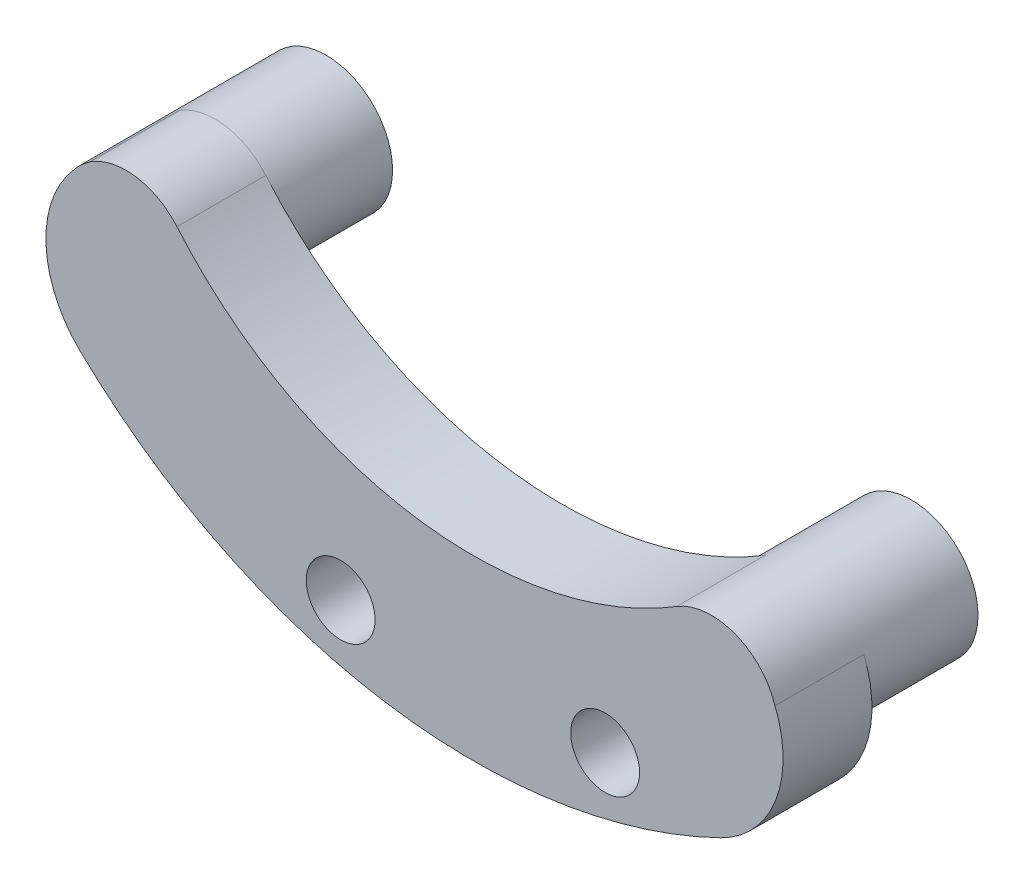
ISO-10303-21;
HEADER;
FILE_DESCRIPTION(('STEP AP214'),'2;1');
FILE_NAME('part.step','',(''),(''),'','','');
FILE_SCHEMA(('AUTOMOTIVE_DESIGN { 1 0 10303 214 1 1 1 1 }'));
ENDSEC;
DATA;
#1=APPLICATION_CONTEXT('core data for automotive mechanical design processes');
#2=APPLICATION_PROTOCOL_DEFINITION('international standard','automotive_design',2000,#1);
#3=PRODUCT_CONTEXT('',#1,'mechanical');
#4=PRODUCT('Part','Part','',(#3));
#5=PRODUCT_RELATED_PRODUCT_CATEGORY('part','',(#4));
#6=PRODUCT_DEFINITION_FORMATION('','',#4);
#7=PRODUCT_DEFINITION_CONTEXT('part definition',#1,'design');
#8=PRODUCT_DEFINITION('design','',#6,#7);
#9=PRODUCT_DEFINITION_SHAPE('','',#8);
#10=(LENGTH_UNIT() NAMED_UNIT(*) SI_UNIT(.MILLI.,.METRE.));
#11=(NAMED_UNIT(*) PLANE_ANGLE_UNIT() SI_UNIT($,.RADIAN.));
#12=(NAMED_UNIT(*) SI_UNIT($,.STERADIAN.) SOLID_ANGLE_UNIT());
#13=UNCERTAINTY_MEASURE_WITH_UNIT(LENGTH_MEASURE(1.E-05),#10,'distance_accuracy_value','');
#14=(GEOMETRIC_REPRESENTATION_CONTEXT(3) GLOBAL_UNCERTAINTY_ASSIGNED_CONTEXT((#13)) GLOBAL_UNIT_ASSIGNED_CONTEXT((#10,
#11,#12)) REPRESENTATION_CONTEXT('',''));
#15=CARTESIAN_POINT('',(0.,0.,0.));
#16=DIRECTION('',(0.,0.,1.));
#17=DIRECTION('',(1.,0.,0.));
#18=AXIS2_PLACEMENT_3D('',#15,#16,#17);
#19=CARTESIAN_POINT('',(-14.2219376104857,-14.7643655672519,4.));
#20=DIRECTION('',(0.,0.,1.));
#21=DIRECTION('',(1.,0.,0.));
#22=AXIS2_PLACEMENT_3D('',#19,#20,#21);
#23=CYLINDRICAL_SURFACE('',#22,5.);
#24=DIRECTION('',(0.,0.,1.));
#25=VECTOR('',#24,1.);
#26=CARTESIAN_POINT('',(-17.9747598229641,-11.4603792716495,-0.5));
#27=LINE('',#26,#25);
#28=CARTESIAN_POINT('',(-17.9747598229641,-11.4603792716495,0.));
#29=VERTEX_POINT('',#28);
#30=CARTESIAN_POINT('',(-17.9747598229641,-11.4603792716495,4.));
#31=VERTEX_POINT('',#30);
#32=EDGE_CURVE('E42',#29,#31,#27,.T.);
#33=ORIENTED_EDGE('',*,*,#32,.F.);
#34=CARTESIAN_POINT('',(-14.2219376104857,-14.7643655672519,0.));
#35=DIRECTION('',(0.,0.,1.));
#36=DIRECTION('',(1.,0.,0.));
#37=AXIS2_PLACEMENT_3D('',#34,#35,#36);
#38=CIRCLE('',#37,5.);
#39=CARTESIAN_POINT('',(-17.6907028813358,-18.3654303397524,0.));
#40=VERTEX_POINT('',#39);
#41=EDGE_CURVE('E143',#40,#29,#38,.F.);
#42=ORIENTED_EDGE('',*,*,#41,.F.);
#43=DIRECTION('',(0.,0.,-1.));
#44=VECTOR('',#43,1.);
#45=CARTESIAN_POINT('',(-17.6907028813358,-18.3654303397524,4.));
#46=LINE('',#45,#44);
#47=CARTESIAN_POINT('',(-17.6907028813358,-18.3654303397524,4.));
#48=VERTEX_POINT('',#47);
#49=EDGE_CURVE('E139',#48,#40,#46,.T.);
#50=ORIENTED_EDGE('',*,*,#49,.F.);
#51=CARTESIAN_POINT('',(-14.2219376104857,-14.7643655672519,4.));
#52=DIRECTION('',(0.,0.,1.));
#53=DIRECTION('',(1.,0.,0.));
#54=AXIS2_PLACEMENT_3D('',#51,#52,#53);
#55=CIRCLE('',#54,5.);
#56=EDGE_CURVE('E125',#31,#48,#55,.T.);
#57=ORIENTED_EDGE('',*,*,#56,.F.);
#58=EDGE_LOOP('',(#33,#42,#50,#57));
#59=FACE_BOUND('',#58,.T.);
#60=ADVANCED_FACE('F34',(#59),#23,.T.);
#61=CARTESIAN_POINT('',(0.,0.,4.));
#62=DIRECTION('',(0.,0.,1.));
#63=DIRECTION('',(1.,0.,0.));
#64=AXIS2_PLACEMENT_3D('',#61,#62,#63);
#65=PLANE('',#64);
#66=CARTESIAN_POINT('',(8.96342656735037,-18.436566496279,4.));
#67=DIRECTION('',(0.,0.,1.));
#68=DIRECTION('',(1.,0.,0.));
#69=AXIS2_PLACEMENT_3D('',#66,#67,#68);
#70=CIRCLE('',#69,5.);
#71=CARTESIAN_POINT('',(11.1496281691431,-22.9332900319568,4.));
#72=VERTEX_POINT('',#71);
#73=CARTESIAN_POINT('',(13.5980959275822,-16.5604428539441,4.));
#74=VERTEX_POINT('',#73);
#75=EDGE_CURVE('E116',#72,#74,#70,.T.);
#76=ORIENTED_EDGE('',*,*,#75,.T.);
#77=CARTESIAN_POINT('',(10.7371493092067,-17.4632077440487,4.));
#78=DIRECTION('',(0.,0.,1.));
#79=DIRECTION('',(1.,0.,0.));
#80=AXIS2_PLACEMENT_3D('',#77,#78,#79);
#81=CIRCLE('',#80,3.);
#82=CARTESIAN_POINT('',(9.16585916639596,-14.9076163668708,4.));
#83=VERTEX_POINT('',#82);
#84=EDGE_CURVE('E99',#74,#83,#81,.T.);
#85=ORIENTED_EDGE('',*,*,#84,.T.);
#86=CARTESIAN_POINT('',(0.,0.,4.));
#87=DIRECTION('',(0.,0.,-1.));
#88=DIRECTION('',(1.,0.,0.));
#89=AXIS2_PLACEMENT_3D('',#86,#87,#88);
#90=CIRCLE('',#89,17.5);
#91=CARTESIAN_POINT('',(-13.3239568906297,-11.3455794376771,4.));
#92=VERTEX_POINT('',#91);
#93=EDGE_CURVE('E156',#83,#92,#90,.T.);
#94=ORIENTED_EDGE('',*,*,#93,.T.);
#95=CARTESIAN_POINT('',(-15.6080637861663,-13.2905359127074,4.));
#96=DIRECTION('',(0.,0.,1.));
#97=DIRECTION('',(1.,0.,0.));
#98=AXIS2_PLACEMENT_3D('',#95,#96,#97);
#99=CIRCLE('',#98,3.);
#100=CARTESIAN_POINT('',(-17.1978215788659,-10.7463916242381,4.));
#101=VERTEX_POINT('',#100);
#102=EDGE_CURVE('E110',#92,#101,#99,.T.);
#103=ORIENTED_EDGE('',*,*,#102,.T.);
#104=CARTESIAN_POINT('',(-17.289763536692,-10.8161451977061,4.));
#105=VERTEX_POINT('',#104);
#106=EDGE_CURVE('E122',#101,#105,#55,.T.);
#107=ORIENTED_EDGE('',*,*,#106,.T.);
#108=CARTESIAN_POINT('',(-15.6080637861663,-13.2905359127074,4.));
#109=DIRECTION('',(0.,0.,1.));
#110=DIRECTION('',(1.,0.,0.));
#111=AXIS2_PLACEMENT_3D('',#108,#109,#110);
#112=CIRCLE('',#111,2.99177597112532);
#113=EDGE_CURVE('E49',#105,#31,#112,.T.);
#114=ORIENTED_EDGE('',*,*,#113,.T.);
#115=ORIENTED_EDGE('',*,*,#56,.T.);
#116=CARTESIAN_POINT('',(0.,0.,4.));
#117=DIRECTION('',(0.,0.,1.));
#118=DIRECTION('',(1.,0.,0.));
#119=AXIS2_PLACEMENT_3D('',#116,#117,#118);
#120=CIRCLE('',#119,25.5);
#121=EDGE_CURVE('E120',#48,#72,#120,.T.);
#122=ORIENTED_EDGE('',*,*,#121,.T.);
#123=EDGE_LOOP('',(#76,#85,#94,#103,#107,#114,#115,#122));
#124=FACE_BOUND('',#123,.T.);
#125=CARTESIAN_POINT('',(5.95283803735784,-22.2162940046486,4.));
#126=DIRECTION('',(0.,0.,1.));
#127=DIRECTION('',(1.,0.,0.));
#128=AXIS2_PLACEMENT_3D('',#125,#126,#127);
#129=CIRCLE('',#128,1.55);
#130=CARTESIAN_POINT('',(7.50283803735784,-22.2162940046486,4.));
#131=VERTEX_POINT('',#130);
#132=EDGE_CURVE('E160',#131,#131,#129,.T.);
#133=ORIENTED_EDGE('',*,*,#132,.F.);
#134=EDGE_LOOP('',(#133));
#135=FACE_BOUND('',#134,.T.);
#136=CARTESIAN_POINT('',(-5.95283803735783,-22.2162940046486,4.));
#137=DIRECTION('',(0.,0.,1.));
#138=DIRECTION('',(1.,0.,0.));
#139=AXIS2_PLACEMENT_3D('',#136,#137,#138);
#140=CIRCLE('',#139,1.55);
#141=CARTESIAN_POINT('',(-4.40283803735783,-22.2162940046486,4.));
#142=VERTEX_POINT('',#141);
#143=EDGE_CURVE('E166',#142,#142,#140,.T.);
#144=ORIENTED_EDGE('',*,*,#143,.F.);
#145=EDGE_LOOP('',(#144));
#146=FACE_BOUND('',#145,.T.);
#147=ADVANCED_FACE('F118',(#124,#135,#146),#65,.T.);
#148=CARTESIAN_POINT('',(0.,0.,0.));
#149=DIRECTION('',(0.,0.,1.));
#150=DIRECTION('',(1.,0.,0.));
#151=AXIS2_PLACEMENT_3D('',#148,#149,#150);
#152=PLANE('',#151);
#153=CARTESIAN_POINT('',(0.,0.,0.));
#154=DIRECTION('',(0.,0.,-1.));
#155=DIRECTION('',(1.,0.,0.));
#156=AXIS2_PLACEMENT_3D('',#153,#154,#155);
#157=CIRCLE('',#156,17.5);
#158=CARTESIAN_POINT('',(9.16585916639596,-14.9076163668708,0.));
#159=VERTEX_POINT('',#158);
#160=CARTESIAN_POINT('',(-13.3239568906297,-11.3455794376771,0.));
#161=VERTEX_POINT('',#160);
#162=EDGE_CURVE('E157',#159,#161,#157,.T.);
#163=ORIENTED_EDGE('',*,*,#162,.F.);
#164=CARTESIAN_POINT('',(10.7371493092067,-17.4632077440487,0.));
#165=DIRECTION('',(0.,0.,1.));
#166=DIRECTION('',(1.,0.,0.));
#167=AXIS2_PLACEMENT_3D('',#164,#165,#166);
#168=CIRCLE('',#167,3.);
#169=CARTESIAN_POINT('',(13.5980959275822,-16.5604428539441,0.));
#170=VERTEX_POINT('',#169);
#171=EDGE_CURVE('E177',#159,#170,#168,.T.);
#172=ORIENTED_EDGE('',*,*,#171,.T.);
#173=CARTESIAN_POINT('',(8.96342656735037,-18.436566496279,0.));
#174=DIRECTION('',(0.,0.,1.));
#175=DIRECTION('',(1.,0.,0.));
#176=AXIS2_PLACEMENT_3D('',#173,#174,#175);
#177=CIRCLE('',#176,5.);
#178=CARTESIAN_POINT('',(11.1496281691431,-22.9332900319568,0.));
#179=VERTEX_POINT('',#178);
#180=EDGE_CURVE('E117',#170,#179,#177,.F.);
#181=ORIENTED_EDGE('',*,*,#180,.T.);
#182=CARTESIAN_POINT('',(0.,0.,0.));
#183=DIRECTION('',(0.,0.,1.));
#184=DIRECTION('',(1.,0.,0.));
#185=AXIS2_PLACEMENT_3D('',#182,#183,#184);
#186=CIRCLE('',#185,25.5);
#187=EDGE_CURVE('E154',#40,#179,#186,.T.);
#188=ORIENTED_EDGE('',*,*,#187,.F.);
#189=ORIENTED_EDGE('',*,*,#41,.T.);
#190=CARTESIAN_POINT('',(-15.6080637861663,-13.2905359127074,0.));
#191=DIRECTION('',(0.,0.,1.));
#192=DIRECTION('',(1.,0.,0.));
#193=AXIS2_PLACEMENT_3D('',#190,#191,#192);
#194=CIRCLE('',#193,2.99177597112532);
#195=CARTESIAN_POINT('',(-17.289763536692,-10.8161451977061,0.));
#196=VERTEX_POINT('',#195);
#197=EDGE_CURVE('E134',#29,#196,#194,.T.);
#198=ORIENTED_EDGE('',*,*,#197,.T.);
#199=CARTESIAN_POINT('',(-17.1978215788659,-10.7463916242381,0.));
#200=VERTEX_POINT('',#199);
#201=EDGE_CURVE('E145',#196,#200,#38,.F.);
#202=ORIENTED_EDGE('',*,*,#201,.T.);
#203=CARTESIAN_POINT('',(-15.6080637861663,-13.2905359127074,0.));
#204=DIRECTION('',(0.,0.,1.));
#205=DIRECTION('',(1.,0.,0.));
#206=AXIS2_PLACEMENT_3D('',#203,#204,#205);
#207=CIRCLE('',#206,3.);
#208=EDGE_CURVE('E149',#200,#161,#207,.F.);
#209=ORIENTED_EDGE('',*,*,#208,.T.);
#210=EDGE_LOOP('',(#163,#172,#181,#188,#189,#198,#202,#209));
#211=FACE_BOUND('',#210,.T.);
#212=CARTESIAN_POINT('',(5.95283803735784,-22.2162940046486,0.));
#213=DIRECTION('',(0.,0.,1.));
#214=DIRECTION('',(1.,0.,0.));
#215=AXIS2_PLACEMENT_3D('',#212,#213,#214);
#216=CIRCLE('',#215,1.55);
#217=CARTESIAN_POINT('',(7.50283803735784,-22.2162940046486,0.));
#218=VERTEX_POINT('',#217);
#219=EDGE_CURVE('E163',#218,#218,#216,.T.);
#220=ORIENTED_EDGE('',*,*,#219,.T.);
#221=EDGE_LOOP('',(#220));
#222=FACE_BOUND('',#221,.T.);
#223=CARTESIAN_POINT('',(-5.95283803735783,-22.2162940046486,0.));
#224=DIRECTION('',(0.,0.,1.));
#225=DIRECTION('',(1.,0.,0.));
#226=AXIS2_PLACEMENT_3D('',#223,#224,#225);
#227=CIRCLE('',#226,1.55);
#228=CARTESIAN_POINT('',(-4.40283803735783,-22.2162940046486,0.));
#229=VERTEX_POINT('',#228);
#230=EDGE_CURVE('E169',#229,#229,#227,.T.);
#231=ORIENTED_EDGE('',*,*,#230,.T.);
#232=EDGE_LOOP('',(#231));
#233=FACE_BOUND('',#232,.T.);
#234=ADVANCED_FACE('F198',(#211,#222,#233),#152,.F.);
#235=CARTESIAN_POINT('',(0.,0.,4.));
#236=DIRECTION('',(0.,0.,-1.));
#237=DIRECTION('',(-1.,0.,0.));
#238=AXIS2_PLACEMENT_3D('',#235,#236,#237);
#239=CYLINDRICAL_SURFACE('',#238,17.5);
#240=ORIENTED_EDGE('',*,*,#93,.F.);
#241=DIRECTION('',(0.,0.,-1.));
#242=VECTOR('',#241,1.);
#243=CARTESIAN_POINT('',(9.16585916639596,-14.9076163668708,4.));
#244=LINE('',#243,#242);
#245=EDGE_CURVE('E105',#83,#159,#244,.T.);
#246=ORIENTED_EDGE('',*,*,#245,.T.);
#247=ORIENTED_EDGE('',*,*,#162,.T.);
#248=DIRECTION('',(0.,0.,-1.));
#249=VECTOR('',#248,1.);
#250=CARTESIAN_POINT('',(-13.3239568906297,-11.3455794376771,4.));
#251=LINE('',#250,#249);
#252=EDGE_CURVE('E152',#161,#92,#251,.F.);
#253=ORIENTED_EDGE('',*,*,#252,.T.);
#254=EDGE_LOOP('',(#240,#246,#247,#253));
#255=FACE_BOUND('',#254,.T.);
#256=ADVANCED_FACE('F220',(#255),#239,.F.);
#257=CARTESIAN_POINT('',(0.,0.,4.));
#258=DIRECTION('',(0.,0.,-1.));
#259=DIRECTION('',(-1.,0.,0.));
#260=AXIS2_PLACEMENT_3D('',#257,#258,#259);
#261=CYLINDRICAL_SURFACE('',#260,25.5);
#262=ORIENTED_EDGE('',*,*,#187,.T.);
#263=DIRECTION('',(0.,0.,-1.));
#264=VECTOR('',#263,1.);
#265=CARTESIAN_POINT('',(11.1496281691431,-22.9332900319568,4.));
#266=LINE('',#265,#264);
#267=EDGE_CURVE('E57',#179,#72,#266,.F.);
#268=ORIENTED_EDGE('',*,*,#267,.T.);
#269=ORIENTED_EDGE('',*,*,#121,.F.);
#270=ORIENTED_EDGE('',*,*,#49,.T.);
#271=EDGE_LOOP('',(#262,#268,#269,#270));
#272=FACE_BOUND('',#271,.T.);
#273=ADVANCED_FACE('F222',(#272),#261,.T.);
#274=CARTESIAN_POINT('',(5.95283803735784,-22.2162940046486,4.));
#275=DIRECTION('',(0.,0.,-1.));
#276=DIRECTION('',(-1.,0.,0.));
#277=AXIS2_PLACEMENT_3D('',#274,#275,#276);
#278=CYLINDRICAL_SURFACE('',#277,1.55);
#279=ORIENTED_EDGE('',*,*,#132,.T.);
#280=EDGE_LOOP('',(#279));
#281=FACE_BOUND('',#280,.T.);
#282=ORIENTED_EDGE('',*,*,#219,.F.);
#283=EDGE_LOOP('',(#282));
#284=FACE_BOUND('',#283,.T.);
#285=ADVANCED_FACE('F228',(#281,#284),#278,.F.);
#286=CARTESIAN_POINT('',(-5.95283803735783,-22.2162940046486,4.));
#287=DIRECTION('',(0.,0.,-1.));
#288=DIRECTION('',(-1.,0.,0.));
#289=AXIS2_PLACEMENT_3D('',#286,#287,#288);
#290=CYLINDRICAL_SURFACE('',#289,1.55);
#291=ORIENTED_EDGE('',*,*,#143,.T.);
#292=EDGE_LOOP('',(#291));
#293=FACE_BOUND('',#292,.T.);
#294=ORIENTED_EDGE('',*,*,#230,.F.);
#295=EDGE_LOOP('',(#294));
#296=FACE_BOUND('',#295,.T.);
#297=ADVANCED_FACE('F234',(#293,#296),#290,.F.);
#298=CARTESIAN_POINT('',(10.7371493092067,-17.4632077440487,4.));
#299=DIRECTION('',(0.,0.,-1.));
#300=DIRECTION('',(-1.,0.,0.));
#301=AXIS2_PLACEMENT_3D('',#298,#299,#300);
#302=CYLINDRICAL_SURFACE('',#301,3.);
#303=ORIENTED_EDGE('',*,*,#84,.F.);
#304=DIRECTION('',(0.,0.,1.));
#305=VECTOR('',#304,1.);
#306=CARTESIAN_POINT('',(13.5980959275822,-16.5604428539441,-0.5));
#307=LINE('',#306,#305);
#308=EDGE_CURVE('E11',#74,#170,#307,.F.);
#309=ORIENTED_EDGE('',*,*,#308,.T.);
#310=ORIENTED_EDGE('',*,*,#171,.F.);
#311=ORIENTED_EDGE('',*,*,#245,.F.);
#312=EDGE_LOOP('',(#303,#309,#310,#311));
#313=FACE_BOUND('',#312,.T.);
#314=CARTESIAN_POINT('',(10.7371493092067,-17.4632077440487,-5.));
#315=DIRECTION('',(0.,0.,1.));
#316=DIRECTION('',(1.,0.,0.));
#317=AXIS2_PLACEMENT_3D('',#314,#315,#316);
#318=CIRCLE('',#317,3.);
#319=CARTESIAN_POINT('',(13.7371493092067,-17.4632077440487,-5.));
#320=VERTEX_POINT('',#319);
#321=EDGE_CURVE('E181',#320,#320,#318,.T.);
#322=ORIENTED_EDGE('',*,*,#321,.T.);
#323=EDGE_LOOP('',(#322));
#324=FACE_BOUND('',#323,.T.);
#325=ADVANCED_FACE('F101',(#313,#324),#302,.T.);
#326=CARTESIAN_POINT('',(-15.6080637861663,-13.2905359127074,4.));
#327=DIRECTION('',(0.,0.,-1.));
#328=DIRECTION('',(-1.,0.,0.));
#329=AXIS2_PLACEMENT_3D('',#326,#327,#328);
#330=CYLINDRICAL_SURFACE('',#329,3.);
#331=ORIENTED_EDGE('',*,*,#102,.F.);
#332=ORIENTED_EDGE('',*,*,#252,.F.);
#333=ORIENTED_EDGE('',*,*,#208,.F.);
#334=DIRECTION('',(0.,0.,-1.));
#335=VECTOR('',#334,1.);
#336=CARTESIAN_POINT('',(-17.1978215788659,-10.7463916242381,4.));
#337=LINE('',#336,#335);
#338=EDGE_CURVE('E109',#101,#200,#337,.T.);
#339=ORIENTED_EDGE('',*,*,#338,.F.);
#340=EDGE_LOOP('',(#331,#332,#333,#339));
#341=FACE_BOUND('',#340,.T.);
#342=ADVANCED_FACE('F208',(#341),#330,.T.);
#343=CARTESIAN_POINT('',(8.96342656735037,-18.436566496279,4.));
#344=DIRECTION('',(0.,0.,1.));
#345=DIRECTION('',(1.,0.,0.));
#346=AXIS2_PLACEMENT_3D('',#343,#344,#345);
#347=CYLINDRICAL_SURFACE('',#346,5.);
#348=ORIENTED_EDGE('',*,*,#308,.F.);
#349=ORIENTED_EDGE('',*,*,#75,.F.);
#350=ORIENTED_EDGE('',*,*,#267,.F.);
#351=ORIENTED_EDGE('',*,*,#180,.F.);
#352=EDGE_LOOP('',(#348,#349,#350,#351));
#353=FACE_BOUND('',#352,.T.);
#354=ADVANCED_FACE('F115',(#353),#347,.T.);
#355=DIRECTION('',(0.,0.,1.));
#356=VECTOR('',#355,1.);
#357=CARTESIAN_POINT('',(-17.289763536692,-10.8161451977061,-0.5));
#358=LINE('',#357,#356);
#359=EDGE_CURVE('E121',#105,#196,#358,.F.);
#360=ORIENTED_EDGE('',*,*,#359,.F.);
#361=ORIENTED_EDGE('',*,*,#106,.F.);
#362=ORIENTED_EDGE('',*,*,#338,.T.);
#363=ORIENTED_EDGE('',*,*,#201,.F.);
#364=EDGE_LOOP('',(#360,#361,#362,#363));
#365=FACE_BOUND('',#364,.T.);
#366=ADVANCED_FACE('F36',(#365),#23,.T.);
#367=CARTESIAN_POINT('',(-15.6080637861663,-13.2905359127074,-5.));
#368=DIRECTION('',(0.,0.,1.));
#369=DIRECTION('',(1.,0.,0.));
#370=AXIS2_PLACEMENT_3D('',#367,#368,#369);
#371=CYLINDRICAL_SURFACE('',#370,2.99177597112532);
#372=CARTESIAN_POINT('',(-15.6080637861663,-13.2905359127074,-5.));
#373=DIRECTION('',(0.,0.,1.));
#374=DIRECTION('',(1.,0.,0.));
#375=AXIS2_PLACEMENT_3D('',#372,#373,#374);
#376=CIRCLE('',#375,2.99177597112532);
#377=CARTESIAN_POINT('',(-12.6162878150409,-13.2905359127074,-5.));
#378=VERTEX_POINT('',#377);
#379=EDGE_CURVE('E175',#378,#378,#376,.T.);
#380=ORIENTED_EDGE('',*,*,#379,.T.);
#381=EDGE_LOOP('',(#380));
#382=FACE_BOUND('',#381,.T.);
#383=ORIENTED_EDGE('',*,*,#197,.F.);
#384=ORIENTED_EDGE('',*,*,#32,.T.);
#385=ORIENTED_EDGE('',*,*,#113,.F.);
#386=ORIENTED_EDGE('',*,*,#359,.T.);
#387=EDGE_LOOP('',(#383,#384,#385,#386));
#388=FACE_BOUND('',#387,.T.);
#389=ADVANCED_FACE('F131',(#382,#388),#371,.T.);
#390=CARTESIAN_POINT('',(-15.6080637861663,-13.2905359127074,-5.));
#391=DIRECTION('',(0.,0.,1.));
#392=DIRECTION('',(1.,0.,0.));
#393=AXIS2_PLACEMENT_3D('',#390,#391,#392);
#394=PLANE('',#393);
#395=ORIENTED_EDGE('',*,*,#379,.F.);
#396=EDGE_LOOP('',(#395));
#397=FACE_BOUND('',#396,.T.);
#398=ADVANCED_FACE('F187',(#397),#394,.F.);
#399=CARTESIAN_POINT('',(10.7371493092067,-17.4632077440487,-5.));
#400=DIRECTION('',(0.,0.,1.));
#401=DIRECTION('',(1.,0.,0.));
#402=AXIS2_PLACEMENT_3D('',#399,#400,#401);
#403=PLANE('',#402);
#404=ORIENTED_EDGE('',*,*,#321,.F.);
#405=EDGE_LOOP('',(#404));
#406=FACE_BOUND('',#405,.T.);
#407=ADVANCED_FACE('F185',(#406),#403,.F.);
#408=CLOSED_SHELL('',(#60,#147,#234,#256,#273,#285,#297,#325,#342,#354,#366,#389,#398,#407));
#409=MANIFOLD_SOLID_BREP('B2',#408);
#410=ADVANCED_BREP_SHAPE_REPRESENTATION('',(#18,#409),#14);
#411=SHAPE_DEFINITION_REPRESENTATION(#9,#410);
ENDSEC;
END-ISO-10303-21;
